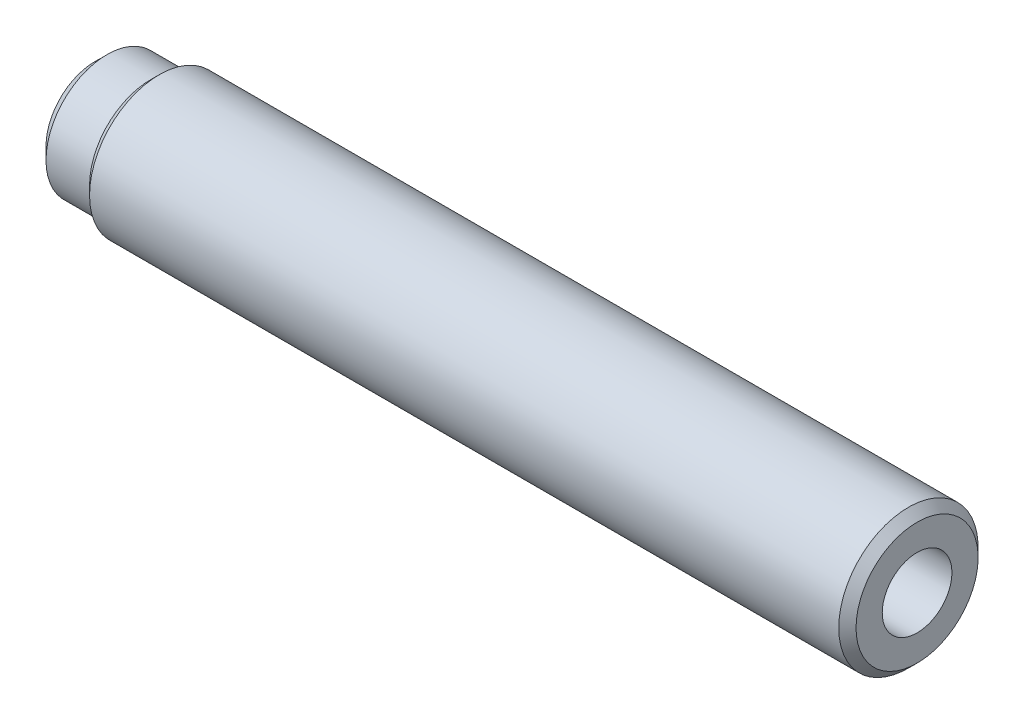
from build123d import *


with BuildPart() as part:
    # Sketch1 → Revolve1 (revolve)
    with BuildSketch(Plane.XY, mode=Mode.PRIVATE) as revolve1_sk:
        Polygon((-74.93, 0), (-74.93, 4.45008), (-73.81748, 5.5626), (-69.85, 5.5626), (-69.0626, 6.35), (-0.7874, 6.35), (0, 5.5626), (0, 3.175), (-21.59, 3.175), (-21.59, 0), align=None)
    revolve(revolve1_sk.sketch.rotate(Axis((0, 0, 0), (-1, 0, 0)), 270), axis=Axis((0, 0, 0), (-1, 0, 0)))


solid = part.part
